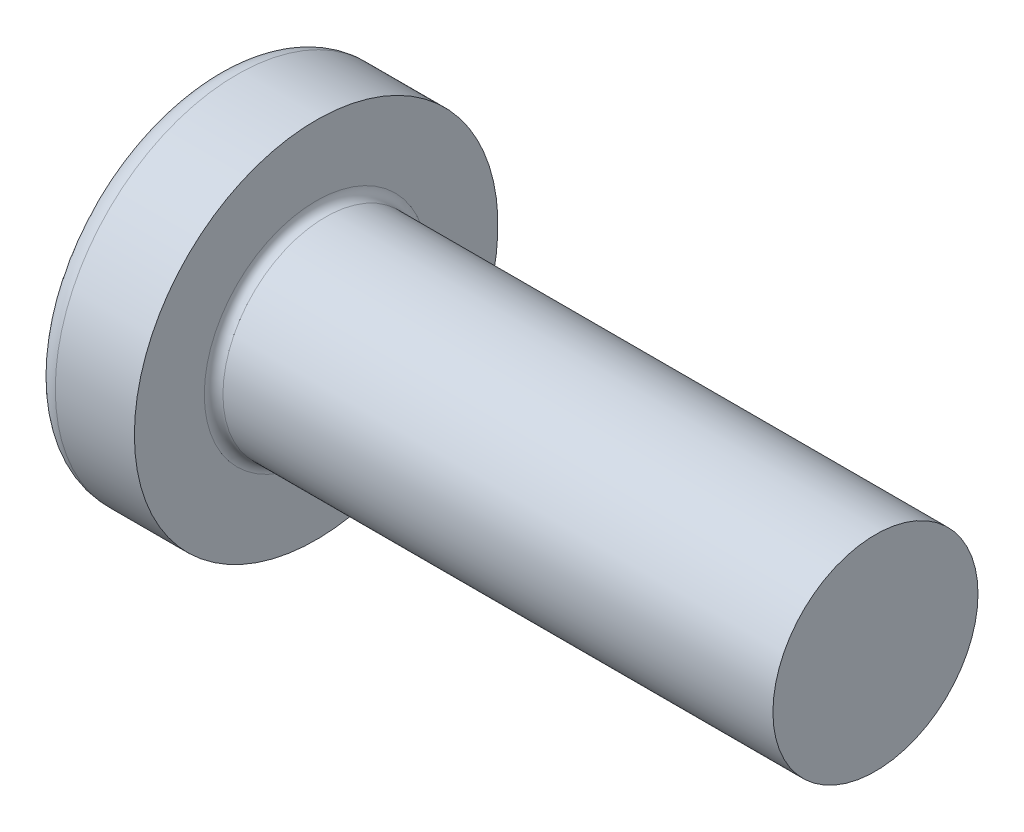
ISO-10303-21;
HEADER;
FILE_DESCRIPTION(('STEP AP214'),'2;1');
FILE_NAME('part.step','',(''),(''),'','','');
FILE_SCHEMA(('AUTOMOTIVE_DESIGN { 1 0 10303 214 1 1 1 1 }'));
ENDSEC;
DATA;
#1=APPLICATION_CONTEXT('core data for automotive mechanical design processes');
#2=APPLICATION_PROTOCOL_DEFINITION('international standard','automotive_design',2000,#1);
#3=PRODUCT_CONTEXT('',#1,'mechanical');
#4=PRODUCT('Part','Part','',(#3));
#5=PRODUCT_RELATED_PRODUCT_CATEGORY('part','',(#4));
#6=PRODUCT_DEFINITION_FORMATION('','',#4);
#7=PRODUCT_DEFINITION_CONTEXT('part definition',#1,'design');
#8=PRODUCT_DEFINITION('design','',#6,#7);
#9=PRODUCT_DEFINITION_SHAPE('','',#8);
#10=(LENGTH_UNIT() NAMED_UNIT(*) SI_UNIT(.MILLI.,.METRE.));
#11=(NAMED_UNIT(*) PLANE_ANGLE_UNIT() SI_UNIT($,.RADIAN.));
#12=(NAMED_UNIT(*) SI_UNIT($,.STERADIAN.) SOLID_ANGLE_UNIT());
#13=UNCERTAINTY_MEASURE_WITH_UNIT(LENGTH_MEASURE(1.E-05),#10,'distance_accuracy_value','');
#14=(GEOMETRIC_REPRESENTATION_CONTEXT(3) GLOBAL_UNCERTAINTY_ASSIGNED_CONTEXT((#13)) GLOBAL_UNIT_ASSIGNED_CONTEXT((#10,
#11,#12)) REPRESENTATION_CONTEXT('',''));
#15=CARTESIAN_POINT('',(0.,0.,0.));
#16=DIRECTION('',(0.,0.,1.));
#17=DIRECTION('',(1.,0.,0.));
#18=AXIS2_PLACEMENT_3D('',#15,#16,#17);
#19=CARTESIAN_POINT('',(1.20000000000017,0.601702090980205,-0.299999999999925));
#20=DIRECTION('',(-1.,0.,0.));
#21=DIRECTION('',(0.,0.,1.));
#22=AXIS2_PLACEMENT_3D('',#19,#20,#21);
#23=PLANE('',#22);
#24=DIRECTION('',(0.,0.,-1.));
#25=VECTOR('',#24,1.);
#26=CARTESIAN_POINT('',(1.20000000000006,0.299999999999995,0.601702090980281));
#27=LINE('',#26,#25);
#28=CARTESIAN_POINT('',(1.20000000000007,0.299999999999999,-0.601702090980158));
#29=VERTEX_POINT('',#28);
#30=CARTESIAN_POINT('',(1.19999999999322,0.300000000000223,-0.468119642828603));
#31=VERTEX_POINT('',#30);
#32=EDGE_CURVE('E270',#29,#31,#27,.F.);
#33=ORIENTED_EDGE('',*,*,#32,.F.);
#34=DIRECTION('',(0.,1.,0.));
#35=VECTOR('',#34,1.);
#36=CARTESIAN_POINT('',(1.20000000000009,0.30000000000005,-0.601702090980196));
#37=LINE('',#36,#35);
#38=CARTESIAN_POINT('',(1.20000000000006,-0.300000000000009,-0.601702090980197));
#39=VERTEX_POINT('',#38);
#40=EDGE_CURVE('E275',#29,#39,#37,.F.);
#41=ORIENTED_EDGE('',*,*,#40,.T.);
#42=DIRECTION('',(0.,0.,1.));
#43=VECTOR('',#42,1.);
#44=CARTESIAN_POINT('',(1.20000000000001,-0.300000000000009,-0.601702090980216));
#45=LINE('',#44,#43);
#46=CARTESIAN_POINT('',(1.19999999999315,-0.300000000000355,-0.468119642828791));
#47=VERTEX_POINT('',#46);
#48=EDGE_CURVE('E322',#47,#39,#45,.F.);
#49=ORIENTED_EDGE('',*,*,#48,.F.);
#50=CARTESIAN_POINT('',(1.20000000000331,0.,0.));
#51=DIRECTION('',(-1.,0.,0.));
#52=DIRECTION('',(0.,0.,1.));
#53=AXIS2_PLACEMENT_3D('',#50,#51,#52);
#54=CIRCLE('',#53,0.556000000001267);
#55=EDGE_CURVE('E545',#47,#31,#54,.F.);
#56=ORIENTED_EDGE('',*,*,#55,.T.);
#57=EDGE_LOOP('',(#33,#41,#49,#56));
#58=FACE_BOUND('',#57,.T.);
#59=ADVANCED_FACE('F17',(#58),#23,.T.);
#60=CARTESIAN_POINT('',(1.20000000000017,0.601702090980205,-0.299999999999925));
#61=DIRECTION('',(-1.,0.,0.));
#62=DIRECTION('',(0.,0.,1.));
#63=AXIS2_PLACEMENT_3D('',#60,#61,#62);
#64=PLANE('',#63);
#65=DIRECTION('',(0.,1.,0.));
#66=VECTOR('',#65,1.);
#67=CARTESIAN_POINT('',(1.20000000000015,-0.601702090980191,0.300000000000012));
#68=LINE('',#67,#66);
#69=CARTESIAN_POINT('',(1.20000000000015,0.601702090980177,0.300000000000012));
#70=VERTEX_POINT('',#69);
#71=CARTESIAN_POINT('',(1.19999999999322,0.468119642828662,0.30000000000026));
#72=VERTEX_POINT('',#71);
#73=EDGE_CURVE('E140',#70,#72,#68,.F.);
#74=ORIENTED_EDGE('',*,*,#73,.F.);
#75=DIRECTION('',(0.,0.,1.));
#76=VECTOR('',#75,1.);
#77=CARTESIAN_POINT('',(1.20000000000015,0.601702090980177,0.300000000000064));
#78=LINE('',#77,#76);
#79=CARTESIAN_POINT('',(1.20000000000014,0.601702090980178,-0.299999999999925));
#80=VERTEX_POINT('',#79);
#81=EDGE_CURVE('E263',#70,#80,#78,.F.);
#82=ORIENTED_EDGE('',*,*,#81,.T.);
#83=DIRECTION('',(0.,1.,0.));
#84=VECTOR('',#83,1.);
#85=CARTESIAN_POINT('',(1.20000000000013,0.601702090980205,-0.299999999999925));
#86=LINE('',#85,#84);
#87=CARTESIAN_POINT('',(1.19999999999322,0.46811964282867,-0.300000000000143));
#88=VERTEX_POINT('',#87);
#89=EDGE_CURVE('E143',#88,#80,#86,.T.);
#90=ORIENTED_EDGE('',*,*,#89,.F.);
#91=CARTESIAN_POINT('',(1.20000000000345,0.,0.));
#92=DIRECTION('',(-1.,0.,0.));
#93=DIRECTION('',(0.,0.,1.));
#94=AXIS2_PLACEMENT_3D('',#91,#92,#93);
#95=CIRCLE('',#94,0.556000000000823);
#96=EDGE_CURVE('E137',#88,#72,#95,.F.);
#97=ORIENTED_EDGE('',*,*,#96,.T.);
#98=EDGE_LOOP('',(#74,#82,#90,#97));
#99=FACE_BOUND('',#98,.T.);
#100=ADVANCED_FACE('F139',(#99),#64,.T.);
#101=CARTESIAN_POINT('',(1.20000000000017,0.601702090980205,-0.299999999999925));
#102=DIRECTION('',(-1.,0.,0.));
#103=DIRECTION('',(0.,0.,1.));
#104=AXIS2_PLACEMENT_3D('',#101,#102,#103);
#105=PLANE('',#104);
#106=DIRECTION('',(0.,0.,1.));
#107=VECTOR('',#106,1.);
#108=CARTESIAN_POINT('',(1.20000000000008,-0.300000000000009,-0.601702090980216));
#109=LINE('',#108,#107);
#110=CARTESIAN_POINT('',(1.20000000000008,-0.300000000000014,0.601702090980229));
#111=VERTEX_POINT('',#110);
#112=CARTESIAN_POINT('',(1.19999999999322,-0.300000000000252,0.468119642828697));
#113=VERTEX_POINT('',#112);
#114=EDGE_CURVE('E251',#111,#113,#109,.F.);
#115=ORIENTED_EDGE('',*,*,#114,.F.);
#116=DIRECTION('',(0.,1.,0.));
#117=VECTOR('',#116,1.);
#118=CARTESIAN_POINT('',(1.20000000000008,-0.30000000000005,0.601702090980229));
#119=LINE('',#118,#117);
#120=CARTESIAN_POINT('',(1.20000000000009,0.299999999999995,0.601702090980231));
#121=VERTEX_POINT('',#120);
#122=EDGE_CURVE('E256',#111,#121,#119,.T.);
#123=ORIENTED_EDGE('',*,*,#122,.T.);
#124=DIRECTION('',(0.,0.,-1.));
#125=VECTOR('',#124,1.);
#126=CARTESIAN_POINT('',(1.20000000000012,0.299999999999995,0.601702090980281));
#127=LINE('',#126,#125);
#128=CARTESIAN_POINT('',(1.19999999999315,0.300000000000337,0.468119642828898));
#129=VERTEX_POINT('',#128);
#130=EDGE_CURVE('E300',#129,#121,#127,.F.);
#131=ORIENTED_EDGE('',*,*,#130,.F.);
#132=CARTESIAN_POINT('',(1.20000000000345,0.,0.));
#133=DIRECTION('',(-1.,0.,0.));
#134=DIRECTION('',(0.,0.,1.));
#135=AXIS2_PLACEMENT_3D('',#132,#133,#134);
#136=CIRCLE('',#135,0.556000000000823);
#137=EDGE_CURVE('E149',#129,#113,#136,.F.);
#138=ORIENTED_EDGE('',*,*,#137,.T.);
#139=EDGE_LOOP('',(#115,#123,#131,#138));
#140=FACE_BOUND('',#139,.T.);
#141=ADVANCED_FACE('F560',(#140),#105,.T.);
#142=CARTESIAN_POINT('',(1.20000000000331,0.,0.));
#143=DIRECTION('',(-1.,0.,0.));
#144=DIRECTION('',(0.,0.,1.));
#145=AXIS2_PLACEMENT_3D('',#142,#143,#144);
#146=CONICAL_SURFACE('',#145,0.556000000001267,1.25663706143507);
#147=CARTESIAN_POINT('',(1.38065535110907,0.,-1.11022302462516E-12));
#148=VERTEX_POINT('',#147);
#149=VERTEX_LOOP('',#148);
#150=FACE_BOUND('',#149,.T.);
#151=CARTESIAN_POINT('',(1.19999999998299,0.,0.));
#152=DIRECTION('',(-1.,0.,0.));
#153=DIRECTION('',(0.,0.,1.));
#154=AXIS2_PLACEMENT_3D('',#151,#152,#153);
#155=CIRCLE('',#154,0.556000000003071);
#156=EDGE_CURVE('E269',#88,#31,#155,.T.);
#157=ORIENTED_EDGE('',*,*,#156,.T.);
#158=ORIENTED_EDGE('',*,*,#55,.F.);
#159=CARTESIAN_POINT('',(1.19999999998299,0.,0.));
#160=DIRECTION('',(-1.,0.,0.));
#161=DIRECTION('',(0.,0.,1.));
#162=AXIS2_PLACEMENT_3D('',#159,#160,#161);
#163=CIRCLE('',#162,0.556000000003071);
#164=CARTESIAN_POINT('',(1.19999999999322,-0.468119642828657,-0.300000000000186));
#165=VERTEX_POINT('',#164);
#166=EDGE_CURVE('E330',#47,#165,#163,.T.);
#167=ORIENTED_EDGE('',*,*,#166,.T.);
#168=CARTESIAN_POINT('',(1.20000000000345,0.,0.));
#169=DIRECTION('',(-1.,0.,0.));
#170=DIRECTION('',(0.,0.,1.));
#171=AXIS2_PLACEMENT_3D('',#168,#169,#170);
#172=CIRCLE('',#171,0.556000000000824);
#173=CARTESIAN_POINT('',(1.19999999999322,-0.468119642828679,0.300000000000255));
#174=VERTEX_POINT('',#173);
#175=EDGE_CURVE('E290',#174,#165,#172,.F.);
#176=ORIENTED_EDGE('',*,*,#175,.F.);
#177=CARTESIAN_POINT('',(1.19999999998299,0.,0.));
#178=DIRECTION('',(-1.,0.,0.));
#179=DIRECTION('',(0.,0.,1.));
#180=AXIS2_PLACEMENT_3D('',#177,#178,#179);
#181=CIRCLE('',#180,0.556000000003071);
#182=EDGE_CURVE('E250',#174,#113,#181,.T.);
#183=ORIENTED_EDGE('',*,*,#182,.T.);
#184=ORIENTED_EDGE('',*,*,#137,.F.);
#185=CARTESIAN_POINT('',(1.19999999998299,0.,0.));
#186=DIRECTION('',(-1.,0.,0.));
#187=DIRECTION('',(0.,0.,1.));
#188=AXIS2_PLACEMENT_3D('',#185,#186,#187);
#189=CIRCLE('',#188,0.556000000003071);
#190=EDGE_CURVE('E162',#129,#72,#189,.T.);
#191=ORIENTED_EDGE('',*,*,#190,.T.);
#192=ORIENTED_EDGE('',*,*,#96,.F.);
#193=EDGE_LOOP('',(#157,#158,#167,#176,#183,#184,#191,#192));
#194=FACE_BOUND('',#193,.T.);
#195=ADVANCED_FACE('F163',(#150,#194),#146,.F.);
#196=CARTESIAN_POINT('',(1.20000000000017,0.601702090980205,-0.299999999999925));
#197=DIRECTION('',(-1.,0.,0.));
#198=DIRECTION('',(0.,0.,1.));
#199=AXIS2_PLACEMENT_3D('',#196,#197,#198);
#200=PLANE('',#199);
#201=DIRECTION('',(0.,1.,0.));
#202=VECTOR('',#201,1.);
#203=CARTESIAN_POINT('',(1.20000000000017,0.601702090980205,-0.299999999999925));
#204=LINE('',#203,#202);
#205=CARTESIAN_POINT('',(1.20000000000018,-0.601702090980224,-0.299999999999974));
#206=VERTEX_POINT('',#205);
#207=EDGE_CURVE('E286',#206,#165,#204,.T.);
#208=ORIENTED_EDGE('',*,*,#207,.F.);
#209=DIRECTION('',(0.,0.,1.));
#210=VECTOR('',#209,1.);
#211=CARTESIAN_POINT('',(1.20000000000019,-0.601702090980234,-0.300000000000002));
#212=LINE('',#211,#210);
#213=CARTESIAN_POINT('',(1.20000000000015,-0.601702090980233,0.300000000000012));
#214=VERTEX_POINT('',#213);
#215=EDGE_CURVE('E238',#206,#214,#212,.T.);
#216=ORIENTED_EDGE('',*,*,#215,.T.);
#217=DIRECTION('',(0.,1.,0.));
#218=VECTOR('',#217,1.);
#219=CARTESIAN_POINT('',(1.20000000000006,-0.601702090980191,0.300000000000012));
#220=LINE('',#219,#218);
#221=EDGE_CURVE('E244',#174,#214,#220,.F.);
#222=ORIENTED_EDGE('',*,*,#221,.F.);
#223=ORIENTED_EDGE('',*,*,#175,.T.);
#224=EDGE_LOOP('',(#208,#216,#222,#223));
#225=FACE_BOUND('',#224,.T.);
#226=ADVANCED_FACE('F549',(#225),#200,.T.);
#227=CARTESIAN_POINT('',(1.20000000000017,0.601702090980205,-0.299999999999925));
#228=DIRECTION('',(0.,0.,1.));
#229=DIRECTION('',(1.,0.,0.));
#230=AXIS2_PLACEMENT_3D('',#227,#228,#229);
#231=PLANE('',#230);
#232=CARTESIAN_POINT('',(0.170303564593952,-1.11508977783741,-0.299999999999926));
#233=CARTESIAN_POINT('',(0.143844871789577,-1.02418894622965,-0.299999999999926));
#234=CARTESIAN_POINT('',(0.12066873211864,-0.932580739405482,-0.299999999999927));
#235=CARTESIAN_POINT('',(0.080881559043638,-0.747949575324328,-0.299999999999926));
#236=CARTESIAN_POINT('',(0.0642705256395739,-0.654926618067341,-0.299999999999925));
#237=CARTESIAN_POINT('',(0.0509420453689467,-0.561196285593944,-0.299999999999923));
#238=B_SPLINE_CURVE_WITH_KNOTS('',3,(#232,#233,#234,#235,#236,#237),.UNSPECIFIED.,.F.,.F.,(4,2,
4),(0.,0.283483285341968,0.566966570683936),.UNSPECIFIED.);
#239=CARTESIAN_POINT('',(0.170303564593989,-1.11508977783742,-0.299999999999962));
#240=VERTEX_POINT('',#239);
#241=CARTESIAN_POINT('',(0.0509420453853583,-0.561196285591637,-0.299999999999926));
#242=VERTEX_POINT('',#241);
#243=EDGE_CURVE('E237',#240,#242,#238,.T.);
#244=ORIENTED_EDGE('',*,*,#243,.F.);
#245=DIRECTION('',(0.89493436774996,0.446197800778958,0.));
#246=VECTOR('',#245,1.);
#247=CARTESIAN_POINT('',(1.66533453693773E-13,-1.20000000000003,-0.299999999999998));
#248=LINE('',#247,#246);
#249=EDGE_CURVE('E241',#240,#206,#248,.T.);
#250=ORIENTED_EDGE('',*,*,#249,.T.);
#251=ORIENTED_EDGE('',*,*,#207,.T.);
#252=CARTESIAN_POINT('',(1.19999999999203,-0.468119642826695,-0.299999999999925));
#253=CARTESIAN_POINT('',(1.00851907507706,-0.4839872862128,-0.299999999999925));
#254=CARTESIAN_POINT('',(0.817023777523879,-0.49967749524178,-0.299999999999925));
#255=CARTESIAN_POINT('',(0.43400445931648,-0.530703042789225,-0.299999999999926));
#256=CARTESIAN_POINT('',(0.242480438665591,-0.546038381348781,-0.299999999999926));
#257=CARTESIAN_POINT('',(0.0509420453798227,-0.561196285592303,-0.299999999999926));
#258=B_SPLINE_CURVE_WITH_KNOTS('',3,(#252,#253,#254,#255,#256,#257),.UNSPECIFIED.,.F.,.F.,(4,2,
4),(0.,0.576411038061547,1.15282200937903),.UNSPECIFIED.);
#259=EDGE_CURVE('E289',#165,#242,#258,.T.);
#260=ORIENTED_EDGE('',*,*,#259,.T.);
#261=EDGE_LOOP('',(#244,#250,#251,#260));
#262=FACE_BOUND('',#261,.T.);
#263=ADVANCED_FACE('F470',(#262),#231,.T.);
#264=CARTESIAN_POINT('',(0.0509420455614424,0.,0.));
#265=DIRECTION('',(-1.,0.,0.));
#266=DIRECTION('',(0.,0.,1.));
#267=AXIS2_PLACEMENT_3D('',#264,#265,#266);
#268=CONICAL_SURFACE('',#267,0.63634995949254,0.0698131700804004);
#269=CARTESIAN_POINT('',(0.0509420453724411,-0.300000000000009,-0.5611962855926));
#270=CARTESIAN_POINT('',(0.242480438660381,-0.300000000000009,-0.546038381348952));
#271=CARTESIAN_POINT('',(0.434004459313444,-0.300000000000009,-0.530703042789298));
#272=CARTESIAN_POINT('',(0.817023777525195,-0.300000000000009,-0.499677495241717));
#273=CARTESIAN_POINT('',(1.00851907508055,-0.300000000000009,-0.483987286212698));
#274=CARTESIAN_POINT('',(1.19999999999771,-0.300000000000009,-0.468119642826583));
#275=B_SPLINE_CURVE_WITH_KNOTS('',3,(#269,#270,#271,#272,#273,#274),.UNSPECIFIED.,.F.,.F.,(4,2,
4),(0.,0.576410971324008,1.15282200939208),.UNSPECIFIED.);
#276=CARTESIAN_POINT('',(0.0509420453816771,-0.300000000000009,-0.561196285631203));
#277=VERTEX_POINT('',#276);
#278=EDGE_CURVE('E327',#277,#47,#275,.T.);
#279=ORIENTED_EDGE('',*,*,#278,.F.);
#280=CARTESIAN_POINT('',(0.0509420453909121,0.,0.));
#281=DIRECTION('',(-1.,0.,0.));
#282=DIRECTION('',(0.,0.,1.));
#283=AXIS2_PLACEMENT_3D('',#280,#281,#282);
#284=CIRCLE('',#283,0.636349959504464);
#285=EDGE_CURVE('E462',#242,#277,#284,.F.);
#286=ORIENTED_EDGE('',*,*,#285,.F.);
#287=ORIENTED_EDGE('',*,*,#259,.F.);
#288=ORIENTED_EDGE('',*,*,#166,.F.);
#289=EDGE_LOOP('',(#279,#286,#287,#288));
#290=FACE_BOUND('',#289,.T.);
#291=ADVANCED_FACE('F443',(#290),#268,.F.);
#292=CARTESIAN_POINT('',(1.20000000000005,-0.300000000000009,-0.601702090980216));
#293=DIRECTION('',(0.,1.,0.));
#294=DIRECTION('',(0.,0.,1.));
#295=AXIS2_PLACEMENT_3D('',#292,#293,#294);
#296=PLANE('',#295);
#297=ORIENTED_EDGE('',*,*,#48,.T.);
#298=DIRECTION('',(-0.894934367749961,0.,-0.446197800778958));
#299=VECTOR('',#298,1.);
#300=CARTESIAN_POINT('',(1.11854539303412E-13,-0.300000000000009,-1.19999999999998));
#301=LINE('',#300,#299);
#302=CARTESIAN_POINT('',(0.170303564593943,-0.30000000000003,-1.11508977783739));
#303=VERTEX_POINT('',#302);
#304=EDGE_CURVE('E273',#39,#303,#301,.T.);
#305=ORIENTED_EDGE('',*,*,#304,.T.);
#306=CARTESIAN_POINT('',(4.0000000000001,-0.300000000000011,0.));
#307=DIRECTION('',(0.,1.,0.));
#308=DIRECTION('',(-1.,0.,0.));
#309=AXIS2_PLACEMENT_3D('',#306,#307,#308);
#310=CIRCLE('',#309,3.98873413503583);
#311=EDGE_CURVE('E460',#277,#303,#310,.F.);
#312=ORIENTED_EDGE('',*,*,#311,.F.);
#313=ORIENTED_EDGE('',*,*,#278,.T.);
#314=EDGE_LOOP('',(#297,#305,#312,#313));
#315=FACE_BOUND('',#314,.T.);
#316=ADVANCED_FACE('F445',(#315),#296,.T.);
#317=CARTESIAN_POINT('',(1.11022302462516E-13,0.30000000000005,-1.19999999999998));
#318=DIRECTION('',(0.446197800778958,0.,-0.894934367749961));
#319=DIRECTION('',(-0.894934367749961,0.,-0.446197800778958));
#320=AXIS2_PLACEMENT_3D('',#317,#318,#319);
#321=PLANE('',#320);
#322=ORIENTED_EDGE('',*,*,#40,.F.);
#323=DIRECTION('',(0.894934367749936,0.,0.446197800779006));
#324=VECTOR('',#323,1.);
#325=CARTESIAN_POINT('',(0.170303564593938,0.300000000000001,-1.11508977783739));
#326=LINE('',#325,#324);
#327=CARTESIAN_POINT('',(0.170303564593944,0.300000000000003,-1.11508977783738));
#328=VERTEX_POINT('',#327);
#329=EDGE_CURVE('E266',#328,#29,#326,.T.);
#330=ORIENTED_EDGE('',*,*,#329,.F.);
#331=CARTESIAN_POINT('',(0.170303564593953,-0.300000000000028,-1.11508977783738));
#332=CARTESIAN_POINT('',(0.163473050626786,-0.200000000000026,-1.11849534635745));
#333=CARTESIAN_POINT('',(0.160057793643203,-0.100000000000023,-1.12019813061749));
#334=CARTESIAN_POINT('',(0.160057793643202,0.0999999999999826,-1.12019813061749));
#335=CARTESIAN_POINT('',(0.163473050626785,0.199999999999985,-1.11849534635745));
#336=CARTESIAN_POINT('',(0.170303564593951,0.299999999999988,-1.11508977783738));
#337=B_SPLINE_CURVE_WITH_KNOTS('',3,(#331,#332,#333,#334,#335,#336),.UNSPECIFIED.,.F.,.F.,(4,2,
4),(0.,0.300218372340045,0.600436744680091),.UNSPECIFIED.);
#338=EDGE_CURVE('E454',#303,#328,#337,.T.);
#339=ORIENTED_EDGE('',*,*,#338,.F.);
#340=ORIENTED_EDGE('',*,*,#304,.F.);
#341=EDGE_LOOP('',(#322,#330,#339,#340));
#342=FACE_BOUND('',#341,.T.);
#343=ADVANCED_FACE('F448',(#342),#321,.F.);
#344=CARTESIAN_POINT('',(1.20000000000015,0.299999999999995,0.601702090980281));
#345=DIRECTION('',(0.,-1.,0.));
#346=DIRECTION('',(0.,0.,-1.));
#347=AXIS2_PLACEMENT_3D('',#344,#345,#346);
#348=PLANE('',#347);
#349=CARTESIAN_POINT('',(4.0000000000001,0.3,0.));
#350=DIRECTION('',(0.,1.,0.));
#351=DIRECTION('',(-1.,0.,0.));
#352=AXIS2_PLACEMENT_3D('',#349,#350,#351);
#353=CIRCLE('',#352,3.98873413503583);
#354=CARTESIAN_POINT('',(0.050942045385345,0.3,-0.561196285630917));
#355=VERTEX_POINT('',#354);
#356=EDGE_CURVE('E408',#328,#355,#353,.T.);
#357=ORIENTED_EDGE('',*,*,#356,.F.);
#358=ORIENTED_EDGE('',*,*,#329,.T.);
#359=ORIENTED_EDGE('',*,*,#32,.T.);
#360=CARTESIAN_POINT('',(1.19999999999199,0.299999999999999,-0.468119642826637));
#361=CARTESIAN_POINT('',(1.00851907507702,0.299999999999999,-0.483987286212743));
#362=CARTESIAN_POINT('',(0.817023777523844,0.299999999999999,-0.499677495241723));
#363=CARTESIAN_POINT('',(0.43400445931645,0.299999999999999,-0.530703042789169));
#364=CARTESIAN_POINT('',(0.242480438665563,0.299999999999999,-0.546038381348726));
#365=CARTESIAN_POINT('',(0.050942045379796,0.299999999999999,-0.561196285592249));
#366=B_SPLINE_CURVE_WITH_KNOTS('',3,(#360,#361,#362,#363,#364,#365),.UNSPECIFIED.,.F.,.F.,(4,2,
4),(0.,0.576411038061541,1.15282200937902),.UNSPECIFIED.);
#367=EDGE_CURVE('E316',#31,#355,#366,.T.);
#368=ORIENTED_EDGE('',*,*,#367,.T.);
#369=EDGE_LOOP('',(#357,#358,#359,#368));
#370=FACE_BOUND('',#369,.T.);
#371=ADVANCED_FACE('F423',(#370),#348,.T.);
#372=CARTESIAN_POINT('',(0.0509420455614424,0.,0.));
#373=DIRECTION('',(-1.,0.,0.));
#374=DIRECTION('',(0.,0.,1.));
#375=AXIS2_PLACEMENT_3D('',#372,#373,#374);
#376=CONICAL_SURFACE('',#375,0.63634995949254,0.0698131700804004);
#377=ORIENTED_EDGE('',*,*,#367,.F.);
#378=ORIENTED_EDGE('',*,*,#156,.F.);
#379=CARTESIAN_POINT('',(0.0509420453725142,0.561196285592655,-0.299999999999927));
#380=CARTESIAN_POINT('',(0.242480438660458,0.546038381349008,-0.299999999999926));
#381=CARTESIAN_POINT('',(0.434004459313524,0.530703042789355,-0.299999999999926));
#382=CARTESIAN_POINT('',(0.817023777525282,0.499677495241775,-0.299999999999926));
#383=CARTESIAN_POINT('',(1.00851907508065,0.483987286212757,-0.299999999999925));
#384=CARTESIAN_POINT('',(1.1999999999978,0.468119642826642,-0.299999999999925));
#385=B_SPLINE_CURVE_WITH_KNOTS('',3,(#379,#380,#381,#382,#383,#384),.UNSPECIFIED.,.F.,.F.,(4,2,
4),(0.,0.576410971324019,1.1528220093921),.UNSPECIFIED.);
#386=CARTESIAN_POINT('',(0.0509420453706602,0.561196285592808,-0.299999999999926));
#387=VERTEX_POINT('',#386);
#388=EDGE_CURVE('E187',#387,#88,#385,.T.);
#389=ORIENTED_EDGE('',*,*,#388,.F.);
#390=CARTESIAN_POINT('',(0.0509420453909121,0.,0.));
#391=DIRECTION('',(-1.,0.,0.));
#392=DIRECTION('',(0.,0.,1.));
#393=AXIS2_PLACEMENT_3D('',#390,#391,#392);
#394=CIRCLE('',#393,0.636349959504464);
#395=EDGE_CURVE('E407',#355,#387,#394,.F.);
#396=ORIENTED_EDGE('',*,*,#395,.F.);
#397=EDGE_LOOP('',(#377,#378,#389,#396));
#398=FACE_BOUND('',#397,.T.);
#399=ADVANCED_FACE('F417',(#398),#376,.F.);
#400=CARTESIAN_POINT('',(1.20000000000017,0.601702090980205,-0.299999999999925));
#401=DIRECTION('',(0.,0.,1.));
#402=DIRECTION('',(1.,0.,0.));
#403=AXIS2_PLACEMENT_3D('',#400,#401,#402);
#404=PLANE('',#403);
#405=ORIENTED_EDGE('',*,*,#89,.T.);
#406=DIRECTION('',(-0.89493436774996,0.446197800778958,0.));
#407=VECTOR('',#406,1.);
#408=CARTESIAN_POINT('',(1.20000000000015,0.601702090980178,-0.299999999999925));
#409=LINE('',#408,#407);
#410=CARTESIAN_POINT('',(0.170303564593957,1.11508977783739,-0.299999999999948));
#411=VERTEX_POINT('',#410);
#412=EDGE_CURVE('E159',#80,#411,#409,.T.);
#413=ORIENTED_EDGE('',*,*,#412,.T.);
#414=CARTESIAN_POINT('',(0.0509420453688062,0.561196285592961,-0.299999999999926));
#415=CARTESIAN_POINT('',(0.0642705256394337,0.654926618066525,-0.299999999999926));
#416=CARTESIAN_POINT('',(0.0808815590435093,0.747949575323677,-0.299999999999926));
#417=CARTESIAN_POINT('',(0.120668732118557,0.932580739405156,-0.299999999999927));
#418=CARTESIAN_POINT('',(0.143844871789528,1.02418894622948,-0.299999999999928));
#419=CARTESIAN_POINT('',(0.170303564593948,1.1150897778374,-0.299999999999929));
#420=B_SPLINE_CURVE_WITH_KNOTS('',3,(#414,#415,#416,#417,#418,#419),.UNSPECIFIED.,.F.,.F.,(4,2,
4),(0.,0.28348328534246,0.56696657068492),.UNSPECIFIED.);
#421=EDGE_CURVE('E404',#387,#411,#420,.T.);
#422=ORIENTED_EDGE('',*,*,#421,.F.);
#423=ORIENTED_EDGE('',*,*,#388,.T.);
#424=EDGE_LOOP('',(#405,#413,#422,#423));
#425=FACE_BOUND('',#424,.T.);
#426=ADVANCED_FACE('F414',(#425),#404,.T.);
#427=CARTESIAN_POINT('',(1.20000000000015,0.601702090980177,0.300000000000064));
#428=DIRECTION('',(0.446197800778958,0.89493436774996,0.));
#429=DIRECTION('',(-0.89493436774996,0.446197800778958,0.));
#430=AXIS2_PLACEMENT_3D('',#427,#428,#429);
#431=PLANE('',#430);
#432=ORIENTED_EDGE('',*,*,#81,.F.);
#433=DIRECTION('',(0.894934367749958,-0.446197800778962,0.));
#434=VECTOR('',#433,1.);
#435=CARTESIAN_POINT('',(0.170303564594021,1.11508977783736,0.300000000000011));
#436=LINE('',#435,#434);
#437=CARTESIAN_POINT('',(0.170303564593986,1.11508977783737,0.30000000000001));
#438=VERTEX_POINT('',#437);
#439=EDGE_CURVE('E158',#438,#70,#436,.T.);
#440=ORIENTED_EDGE('',*,*,#439,.F.);
#441=CARTESIAN_POINT('',(0.17030356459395,1.11508977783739,-0.299999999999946));
#442=CARTESIAN_POINT('',(0.163473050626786,1.11849534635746,-0.199999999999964));
#443=CARTESIAN_POINT('',(0.160057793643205,1.1201981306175,-0.0999999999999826));
#444=CARTESIAN_POINT('',(0.160057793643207,1.1201981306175,0.100000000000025));
#445=CARTESIAN_POINT('',(0.163473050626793,1.11849534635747,0.200000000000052));
#446=CARTESIAN_POINT('',(0.170303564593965,1.11508977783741,0.300000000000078));
#447=B_SPLINE_CURVE_WITH_KNOTS('',3,(#441,#442,#443,#444,#445,#446),.UNSPECIFIED.,.F.,.F.,(4,2,
4),(0.,0.300218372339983,0.600436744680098),.UNSPECIFIED.);
#448=EDGE_CURVE('E209',#411,#438,#447,.T.);
#449=ORIENTED_EDGE('',*,*,#448,.F.);
#450=ORIENTED_EDGE('',*,*,#412,.F.);
#451=EDGE_LOOP('',(#432,#440,#449,#450));
#452=FACE_BOUND('',#451,.T.);
#453=ADVANCED_FACE('F198',(#452),#431,.F.);
#454=CARTESIAN_POINT('',(1.20000000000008,-0.601702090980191,0.300000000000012));
#455=DIRECTION('',(0.,0.,-1.));
#456=DIRECTION('',(-1.,0.,0.));
#457=AXIS2_PLACEMENT_3D('',#454,#455,#456);
#458=PLANE('',#457);
#459=CARTESIAN_POINT('',(0.170303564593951,1.11508977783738,0.30000000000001));
#460=CARTESIAN_POINT('',(0.143844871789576,1.02418894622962,0.300000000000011));
#461=CARTESIAN_POINT('',(0.120668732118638,0.932580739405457,0.300000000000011));
#462=CARTESIAN_POINT('',(0.0808815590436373,0.7479495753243,0.30000000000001));
#463=CARTESIAN_POINT('',(0.064270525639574,0.654926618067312,0.300000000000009));
#464=CARTESIAN_POINT('',(0.0509420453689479,0.561196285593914,0.300000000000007));
#465=B_SPLINE_CURVE_WITH_KNOTS('',3,(#459,#460,#461,#462,#463,#464),.UNSPECIFIED.,.F.,.F.,(4,2,
4),(0.,0.283483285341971,0.566966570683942),.UNSPECIFIED.);
#466=CARTESIAN_POINT('',(0.050942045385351,0.561196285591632,0.300000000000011));
#467=VERTEX_POINT('',#466);
#468=EDGE_CURVE('E202',#438,#467,#465,.T.);
#469=ORIENTED_EDGE('',*,*,#468,.F.);
#470=ORIENTED_EDGE('',*,*,#439,.T.);
#471=ORIENTED_EDGE('',*,*,#73,.T.);
#472=CARTESIAN_POINT('',(1.19999999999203,0.468119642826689,0.300000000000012));
#473=CARTESIAN_POINT('',(1.00851907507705,0.483987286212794,0.300000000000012));
#474=CARTESIAN_POINT('',(0.81702377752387,0.499677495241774,0.300000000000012));
#475=CARTESIAN_POINT('',(0.434004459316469,0.530703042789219,0.300000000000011));
#476=CARTESIAN_POINT('',(0.242480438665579,0.546038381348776,0.300000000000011));
#477=CARTESIAN_POINT('',(0.050942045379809,0.561196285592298,0.300000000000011));
#478=B_SPLINE_CURVE_WITH_KNOTS('',3,(#472,#473,#474,#475,#476,#477),.UNSPECIFIED.,.F.,.F.,(4,2,
4),(0.,0.57641103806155,1.15282200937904),.UNSPECIFIED.);
#479=EDGE_CURVE('E156',#72,#467,#478,.T.);
#480=ORIENTED_EDGE('',*,*,#479,.T.);
#481=EDGE_LOOP('',(#469,#470,#471,#480));
#482=FACE_BOUND('',#481,.T.);
#483=ADVANCED_FACE('F154',(#482),#458,.T.);
#484=CARTESIAN_POINT('',(0.0509420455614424,0.,0.));
#485=DIRECTION('',(-1.,0.,0.));
#486=DIRECTION('',(0.,0.,1.));
#487=AXIS2_PLACEMENT_3D('',#484,#485,#486);
#488=CONICAL_SURFACE('',#487,0.63634995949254,0.0698131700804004);
#489=CARTESIAN_POINT('',(0.0509420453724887,0.299999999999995,0.561196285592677));
#490=CARTESIAN_POINT('',(0.24248043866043,0.299999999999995,0.54603838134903));
#491=CARTESIAN_POINT('',(0.434004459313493,0.299999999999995,0.530703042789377));
#492=CARTESIAN_POINT('',(0.817023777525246,0.299999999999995,0.499677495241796));
#493=CARTESIAN_POINT('',(1.00851907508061,0.299999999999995,0.483987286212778));
#494=CARTESIAN_POINT('',(1.19999999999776,0.299999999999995,0.468119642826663));
#495=B_SPLINE_CURVE_WITH_KNOTS('',3,(#489,#490,#491,#492,#493,#494),.UNSPECIFIED.,.F.,.F.,(4,2,
4),(0.,0.576410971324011,1.15282200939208),.UNSPECIFIED.);
#496=CARTESIAN_POINT('',(0.0509420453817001,0.299999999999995,0.561196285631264));
#497=VERTEX_POINT('',#496);
#498=EDGE_CURVE('E167',#497,#129,#495,.T.);
#499=ORIENTED_EDGE('',*,*,#498,.F.);
#500=CARTESIAN_POINT('',(0.0509420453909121,0.,0.));
#501=DIRECTION('',(-1.,0.,0.));
#502=DIRECTION('',(0.,0.,1.));
#503=AXIS2_PLACEMENT_3D('',#500,#501,#502);
#504=CIRCLE('',#503,0.636349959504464);
#505=EDGE_CURVE('E171',#467,#497,#504,.F.);
#506=ORIENTED_EDGE('',*,*,#505,.F.);
#507=ORIENTED_EDGE('',*,*,#479,.F.);
#508=ORIENTED_EDGE('',*,*,#190,.F.);
#509=EDGE_LOOP('',(#499,#506,#507,#508));
#510=FACE_BOUND('',#509,.T.);
#511=ADVANCED_FACE('F169',(#510),#488,.F.);
#512=CARTESIAN_POINT('',(1.20000000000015,0.299999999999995,0.601702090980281));
#513=DIRECTION('',(0.,-1.,0.));
#514=DIRECTION('',(0.,0.,-1.));
#515=AXIS2_PLACEMENT_3D('',#512,#513,#514);
#516=PLANE('',#515);
#517=ORIENTED_EDGE('',*,*,#130,.T.);
#518=DIRECTION('',(0.894934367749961,0.,-0.446197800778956));
#519=VECTOR('',#518,1.);
#520=CARTESIAN_POINT('',(1.20000000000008,0.299999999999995,0.601702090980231));
#521=LINE('',#520,#519);
#522=CARTESIAN_POINT('',(0.170303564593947,0.299999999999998,1.11508977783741));
#523=VERTEX_POINT('',#522);
#524=EDGE_CURVE('E254',#121,#523,#521,.F.);
#525=ORIENTED_EDGE('',*,*,#524,.T.);
#526=CARTESIAN_POINT('',(4.0000000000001,0.299999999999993,0.));
#527=DIRECTION('',(0.,1.,0.));
#528=DIRECTION('',(-1.,0.,0.));
#529=AXIS2_PLACEMENT_3D('',#526,#527,#528);
#530=CIRCLE('',#529,3.98873413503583);
#531=EDGE_CURVE('E396',#497,#523,#530,.T.);
#532=ORIENTED_EDGE('',*,*,#531,.F.);
#533=ORIENTED_EDGE('',*,*,#498,.T.);
#534=EDGE_LOOP('',(#517,#525,#532,#533));
#535=FACE_BOUND('',#534,.T.);
#536=ADVANCED_FACE('F387',(#535),#516,.T.);
#537=CARTESIAN_POINT('',(1.20000000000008,-0.30000000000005,0.601702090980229));
#538=DIRECTION('',(0.446197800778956,0.,0.894934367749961));
#539=DIRECTION('',(0.894934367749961,0.,-0.446197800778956));
#540=AXIS2_PLACEMENT_3D('',#537,#538,#539);
#541=PLANE('',#540);
#542=ORIENTED_EDGE('',*,*,#122,.F.);
#543=DIRECTION('',(0.894934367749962,0.,-0.446197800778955));
#544=VECTOR('',#543,1.);
#545=CARTESIAN_POINT('',(0.170303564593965,-0.300000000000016,1.1150897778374));
#546=LINE('',#545,#544);
#547=CARTESIAN_POINT('',(0.17030356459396,-0.300000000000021,1.1150897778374));
#548=VERTEX_POINT('',#547);
#549=EDGE_CURVE('E247',#548,#111,#546,.T.);
#550=ORIENTED_EDGE('',*,*,#549,.F.);
#551=CARTESIAN_POINT('',(0.170303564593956,0.300000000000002,1.11508977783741));
#552=CARTESIAN_POINT('',(0.16347305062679,0.200000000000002,1.11849534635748));
#553=CARTESIAN_POINT('',(0.160057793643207,0.100000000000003,1.12019813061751));
#554=CARTESIAN_POINT('',(0.160057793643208,-0.0999999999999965,1.12019813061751));
#555=CARTESIAN_POINT('',(0.16347305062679,-0.199999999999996,1.11849534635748));
#556=CARTESIAN_POINT('',(0.170303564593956,-0.299999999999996,1.11508977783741));
#557=B_SPLINE_CURVE_WITH_KNOTS('',3,(#551,#552,#553,#554,#555,#556),.UNSPECIFIED.,.F.,.F.,(4,2,
4),(0.,0.300218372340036,0.600436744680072),.UNSPECIFIED.);
#558=EDGE_CURVE('E390',#523,#548,#557,.T.);
#559=ORIENTED_EDGE('',*,*,#558,.F.);
#560=ORIENTED_EDGE('',*,*,#524,.F.);
#561=EDGE_LOOP('',(#542,#550,#559,#560));
#562=FACE_BOUND('',#561,.T.);
#563=ADVANCED_FACE('F383',(#562),#541,.F.);
#564=CARTESIAN_POINT('',(1.20000000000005,-0.300000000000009,-0.601702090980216));
#565=DIRECTION('',(0.,1.,0.));
#566=DIRECTION('',(0.,0.,1.));
#567=AXIS2_PLACEMENT_3D('',#564,#565,#566);
#568=PLANE('',#567);
#569=CARTESIAN_POINT('',(4.0000000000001,-0.300000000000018,0.));
#570=DIRECTION('',(0.,1.,0.));
#571=DIRECTION('',(-1.,0.,0.));
#572=AXIS2_PLACEMENT_3D('',#569,#570,#571);
#573=CIRCLE('',#572,3.98873413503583);
#574=CARTESIAN_POINT('',(0.0509420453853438,-0.300000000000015,0.561196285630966));
#575=VERTEX_POINT('',#574);
#576=EDGE_CURVE('E395',#548,#575,#573,.F.);
#577=ORIENTED_EDGE('',*,*,#576,.F.);
#578=ORIENTED_EDGE('',*,*,#549,.T.);
#579=ORIENTED_EDGE('',*,*,#114,.T.);
#580=CARTESIAN_POINT('',(1.19999999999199,-0.300000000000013,0.468119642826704));
#581=CARTESIAN_POINT('',(1.00851907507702,-0.300000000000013,0.48398728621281));
#582=CARTESIAN_POINT('',(0.817023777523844,-0.300000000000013,0.49967749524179));
#583=CARTESIAN_POINT('',(0.434004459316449,-0.300000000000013,0.530703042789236));
#584=CARTESIAN_POINT('',(0.242480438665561,-0.300000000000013,0.546038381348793));
#585=CARTESIAN_POINT('',(0.0509420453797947,-0.300000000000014,0.561196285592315));
#586=B_SPLINE_CURVE_WITH_KNOTS('',3,(#580,#581,#582,#583,#584,#585),.UNSPECIFIED.,.F.,.F.,(4,2,
4),(0.,0.576411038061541,1.15282200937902),.UNSPECIFIED.);
#587=EDGE_CURVE('E294',#113,#575,#586,.T.);
#588=ORIENTED_EDGE('',*,*,#587,.T.);
#589=EDGE_LOOP('',(#577,#578,#579,#588));
#590=FACE_BOUND('',#589,.T.);
#591=ADVANCED_FACE('F379',(#590),#568,.T.);
#592=CARTESIAN_POINT('',(0.0509420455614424,0.,0.));
#593=DIRECTION('',(-1.,0.,0.));
#594=DIRECTION('',(0.,0.,1.));
#595=AXIS2_PLACEMENT_3D('',#592,#593,#594);
#596=CONICAL_SURFACE('',#595,0.63634995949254,0.0698131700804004);
#597=ORIENTED_EDGE('',*,*,#587,.F.);
#598=ORIENTED_EDGE('',*,*,#182,.F.);
#599=CARTESIAN_POINT('',(0.0509420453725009,-0.561196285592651,0.300000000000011));
#600=CARTESIAN_POINT('',(0.242480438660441,-0.546038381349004,0.300000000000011));
#601=CARTESIAN_POINT('',(0.434004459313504,-0.530703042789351,0.300000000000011));
#602=CARTESIAN_POINT('',(0.817023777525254,-0.499677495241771,0.300000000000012));
#603=CARTESIAN_POINT('',(1.00851907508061,-0.483987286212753,0.300000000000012));
#604=CARTESIAN_POINT('',(1.19999999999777,-0.468119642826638,0.300000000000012));
#605=B_SPLINE_CURVE_WITH_KNOTS('',3,(#599,#600,#601,#602,#603,#604),.UNSPECIFIED.,.F.,.F.,(4,2,
4),(0.,0.576410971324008,1.15282200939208),.UNSPECIFIED.);
#606=CARTESIAN_POINT('',(0.050942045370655,-0.561196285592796,0.300000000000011));
#607=VERTEX_POINT('',#606);
#608=EDGE_CURVE('E280',#607,#174,#605,.T.);
#609=ORIENTED_EDGE('',*,*,#608,.F.);
#610=CARTESIAN_POINT('',(0.0509420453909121,0.,0.));
#611=DIRECTION('',(-1.,0.,0.));
#612=DIRECTION('',(0.,0.,1.));
#613=AXIS2_PLACEMENT_3D('',#610,#611,#612);
#614=CIRCLE('',#613,0.636349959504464);
#615=EDGE_CURVE('E354',#575,#607,#614,.F.);
#616=ORIENTED_EDGE('',*,*,#615,.F.);
#617=EDGE_LOOP('',(#597,#598,#609,#616));
#618=FACE_BOUND('',#617,.T.);
#619=ADVANCED_FACE('F360',(#618),#596,.F.);
#620=CARTESIAN_POINT('',(1.20000000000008,-0.601702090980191,0.300000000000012));
#621=DIRECTION('',(0.,0.,-1.));
#622=DIRECTION('',(-1.,0.,0.));
#623=AXIS2_PLACEMENT_3D('',#620,#621,#622);
#624=PLANE('',#623);
#625=ORIENTED_EDGE('',*,*,#221,.T.);
#626=DIRECTION('',(0.89493436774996,0.446197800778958,0.));
#627=VECTOR('',#626,1.);
#628=CARTESIAN_POINT('',(1.66503730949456E-13,-1.20000000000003,0.300000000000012));
#629=LINE('',#628,#627);
#630=CARTESIAN_POINT('',(0.170303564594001,-1.11508977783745,0.300000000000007));
#631=VERTEX_POINT('',#630);
#632=EDGE_CURVE('E235',#214,#631,#629,.F.);
#633=ORIENTED_EDGE('',*,*,#632,.T.);
#634=CARTESIAN_POINT('',(0.0509420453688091,-0.561196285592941,0.300000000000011));
#635=CARTESIAN_POINT('',(0.064270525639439,-0.654926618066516,0.30000000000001));
#636=CARTESIAN_POINT('',(0.0808815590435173,-0.747949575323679,0.30000000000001));
#637=CARTESIAN_POINT('',(0.120668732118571,-0.932580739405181,0.300000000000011));
#638=CARTESIAN_POINT('',(0.143844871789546,-1.02418894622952,0.300000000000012));
#639=CARTESIAN_POINT('',(0.17030356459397,-1.11508977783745,0.300000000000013));
#640=B_SPLINE_CURVE_WITH_KNOTS('',3,(#634,#635,#636,#637,#638,#639),.UNSPECIFIED.,.F.,.F.,(4,2,
4),(0.,0.283483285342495,0.56696657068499),.UNSPECIFIED.);
#641=EDGE_CURVE('E348',#607,#631,#640,.T.);
#642=ORIENTED_EDGE('',*,*,#641,.F.);
#643=ORIENTED_EDGE('',*,*,#608,.T.);
#644=EDGE_LOOP('',(#625,#633,#642,#643));
#645=FACE_BOUND('',#644,.T.);
#646=ADVANCED_FACE('F356',(#645),#624,.T.);
#647=CARTESIAN_POINT('',(1.66533453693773E-13,-1.20000000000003,-0.300000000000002));
#648=DIRECTION('',(0.446197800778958,-0.89493436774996,0.));
#649=DIRECTION('',(0.89493436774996,0.446197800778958,0.));
#650=AXIS2_PLACEMENT_3D('',#647,#648,#649);
#651=PLANE('',#650);
#652=ORIENTED_EDGE('',*,*,#215,.F.);
#653=ORIENTED_EDGE('',*,*,#249,.F.);
#654=CARTESIAN_POINT('',(0.170303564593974,-1.11508977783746,0.30000000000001));
#655=CARTESIAN_POINT('',(0.163473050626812,-1.11849534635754,0.200000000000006));
#656=CARTESIAN_POINT('',(0.160057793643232,-1.12019813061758,0.100000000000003));
#657=CARTESIAN_POINT('',(0.160057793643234,-1.12019813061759,-0.0999999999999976));
#658=CARTESIAN_POINT('',(0.163473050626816,-1.11849534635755,-0.199999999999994));
#659=CARTESIAN_POINT('',(0.17030356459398,-1.11508977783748,-0.299999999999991));
#660=B_SPLINE_CURVE_WITH_KNOTS('',3,(#654,#655,#656,#657,#658,#659),.UNSPECIFIED.,.F.,.F.,(4,2,
4),(0.,0.300218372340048,0.600436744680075),.UNSPECIFIED.);
#661=EDGE_CURVE('E343',#631,#240,#660,.T.);
#662=ORIENTED_EDGE('',*,*,#661,.F.);
#663=ORIENTED_EDGE('',*,*,#632,.F.);
#664=EDGE_LOOP('',(#652,#653,#662,#663));
#665=FACE_BOUND('',#664,.T.);
#666=ADVANCED_FACE('F222',(#665),#651,.F.);
#667=CARTESIAN_POINT('',(4.0000000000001,0.,0.));
#668=DIRECTION('',(0.,1.,0.));
#669=DIRECTION('',(1.,0.,0.));
#670=AXIS2_PLACEMENT_3D('',#667,#668,#669);
#671=SPHERICAL_SURFACE('',#670,4.);
#672=CARTESIAN_POINT('',(0.437599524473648,0.,0.));
#673=DIRECTION('',(-1.,0.,0.));
#674=DIRECTION('',(0.,0.,1.));
#675=AXIS2_PLACEMENT_3D('',#672,#673,#674);
#676=CIRCLE('',#675,1.81914893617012);
#677=CARTESIAN_POINT('',(0.437599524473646,0.,1.81914893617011));
#678=VERTEX_POINT('',#677);
#679=EDGE_CURVE('E339',#678,#678,#676,.F.);
#680=ORIENTED_EDGE('',*,*,#679,.F.);
#681=EDGE_LOOP('',(#680));
#682=FACE_BOUND('',#681,.T.);
#683=ORIENTED_EDGE('',*,*,#641,.T.);
#684=ORIENTED_EDGE('',*,*,#661,.T.);
#685=ORIENTED_EDGE('',*,*,#243,.T.);
#686=ORIENTED_EDGE('',*,*,#285,.T.);
#687=ORIENTED_EDGE('',*,*,#311,.T.);
#688=ORIENTED_EDGE('',*,*,#338,.T.);
#689=ORIENTED_EDGE('',*,*,#356,.T.);
#690=ORIENTED_EDGE('',*,*,#395,.T.);
#691=ORIENTED_EDGE('',*,*,#421,.T.);
#692=ORIENTED_EDGE('',*,*,#448,.T.);
#693=ORIENTED_EDGE('',*,*,#468,.T.);
#694=ORIENTED_EDGE('',*,*,#505,.T.);
#695=ORIENTED_EDGE('',*,*,#531,.T.);
#696=ORIENTED_EDGE('',*,*,#558,.T.);
#697=ORIENTED_EDGE('',*,*,#576,.T.);
#698=ORIENTED_EDGE('',*,*,#615,.T.);
#699=EDGE_LOOP('',(#683,#684,#685,#686,#687,#688,#689,#690,#691,#692,#693,#694,#695,#696,#697,#698));
#700=FACE_BOUND('',#699,.T.);
#701=ADVANCED_FACE('F215',(#682,#700),#671,.T.);
#702=CARTESIAN_POINT('',(0.651343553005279,0.,0.));
#703=DIRECTION('',(-1.,0.,0.));
#704=DIRECTION('',(0.,0.,1.));
#705=AXIS2_PLACEMENT_3D('',#702,#703,#704);
#706=TOROIDAL_SURFACE('',#705,1.71,0.24);
#707=ORIENTED_EDGE('',*,*,#679,.T.);
#708=EDGE_LOOP('',(#707));
#709=FACE_BOUND('',#708,.T.);
#710=CARTESIAN_POINT('',(0.651343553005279,0.,0.));
#711=DIRECTION('',(-1.,0.,0.));
#712=DIRECTION('',(0.,0.,1.));
#713=AXIS2_PLACEMENT_3D('',#710,#711,#712);
#714=CIRCLE('',#713,1.95);
#715=CARTESIAN_POINT('',(0.651343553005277,0.,1.95));
#716=VERTEX_POINT('',#715);
#717=EDGE_CURVE('E342',#716,#716,#714,.F.);
#718=ORIENTED_EDGE('',*,*,#717,.F.);
#719=EDGE_LOOP('',(#718));
#720=FACE_BOUND('',#719,.T.);
#721=ADVANCED_FACE('F221',(#709,#720),#706,.T.);
#722=CARTESIAN_POINT('',(-25.3999999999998,0.,0.));
#723=DIRECTION('',(-1.,0.,0.));
#724=DIRECTION('',(0.,0.,1.));
#725=AXIS2_PLACEMENT_3D('',#722,#723,#724);
#726=CYLINDRICAL_SURFACE('',#725,1.95);
#727=ORIENTED_EDGE('',*,*,#717,.T.);
#728=EDGE_LOOP('',(#727));
#729=FACE_BOUND('',#728,.T.);
#730=CARTESIAN_POINT('',(1.50000000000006,0.,0.));
#731=DIRECTION('',(-1.,0.,0.));
#732=DIRECTION('',(0.,0.,1.));
#733=AXIS2_PLACEMENT_3D('',#730,#731,#732);
#734=CIRCLE('',#733,1.95);
#735=CARTESIAN_POINT('',(1.50000000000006,0.,1.95));
#736=VERTEX_POINT('',#735);
#737=EDGE_CURVE('E336',#736,#736,#734,.T.);
#738=ORIENTED_EDGE('',*,*,#737,.T.);
#739=EDGE_LOOP('',(#738));
#740=FACE_BOUND('',#739,.T.);
#741=ADVANCED_FACE('F521',(#729,#740),#726,.T.);
#742=CARTESIAN_POINT('',(1.50000000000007,1.10000000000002,0.));
#743=DIRECTION('',(-1.,0.,0.));
#744=DIRECTION('',(0.,0.,1.));
#745=AXIS2_PLACEMENT_3D('',#742,#743,#744);
#746=PLANE('',#745);
#747=ORIENTED_EDGE('',*,*,#737,.F.);
#748=EDGE_LOOP('',(#747));
#749=FACE_BOUND('',#748,.T.);
#750=CARTESIAN_POINT('',(1.50000000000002,0.,0.));
#751=DIRECTION('',(1.,0.,0.));
#752=DIRECTION('',(0.,0.,1.));
#753=AXIS2_PLACEMENT_3D('',#750,#751,#752);
#754=CIRCLE('',#753,1.20000000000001);
#755=CARTESIAN_POINT('',(1.50000000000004,0.,-1.19999999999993));
#756=VERTEX_POINT('',#755);
#757=CARTESIAN_POINT('',(1.50000000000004,0.,1.20000000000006));
#758=VERTEX_POINT('',#757);
#759=EDGE_CURVE('E335',#756,#758,#754,.F.);
#760=ORIENTED_EDGE('',*,*,#759,.T.);
#761=CARTESIAN_POINT('',(1.50000000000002,0.,0.));
#762=DIRECTION('',(1.,0.,0.));
#763=DIRECTION('',(0.,0.,-1.));
#764=AXIS2_PLACEMENT_3D('',#761,#762,#763);
#765=CIRCLE('',#764,1.19999999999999);
#766=EDGE_CURVE('E36',#756,#758,#765,.T.);
#767=ORIENTED_EDGE('',*,*,#766,.F.);
#768=EDGE_LOOP('',(#760,#767));
#769=FACE_BOUND('',#768,.T.);
#770=ADVANCED_FACE('F513',(#749,#769),#746,.F.);
#771=CARTESIAN_POINT('',(7.5000000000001,1.09999999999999,0.));
#772=DIRECTION('',(1.,0.,0.));
#773=DIRECTION('',(0.,0.,-1.));
#774=AXIS2_PLACEMENT_3D('',#771,#772,#773);
#775=PLANE('',#774);
#776=CARTESIAN_POINT('',(7.50000000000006,0.,0.));
#777=DIRECTION('',(-1.,0.,0.));
#778=DIRECTION('',(0.,0.,1.));
#779=AXIS2_PLACEMENT_3D('',#776,#777,#778);
#780=CIRCLE('',#779,1.1);
#781=CARTESIAN_POINT('',(7.50000000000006,0.,1.10000000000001));
#782=VERTEX_POINT('',#781);
#783=EDGE_CURVE('E28',#782,#782,#780,.T.);
#784=ORIENTED_EDGE('',*,*,#783,.F.);
#785=EDGE_LOOP('',(#784));
#786=FACE_BOUND('',#785,.T.);
#787=ADVANCED_FACE('F498',(#786),#775,.T.);
#788=CARTESIAN_POINT('',(1.60000000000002,0.,0.));
#789=DIRECTION('',(-1.,0.,0.));
#790=DIRECTION('',(0.,0.,1.));
#791=AXIS2_PLACEMENT_3D('',#788,#789,#790);
#792=TOROIDAL_SURFACE('',#791,1.2,0.1);
#793=ORIENTED_EDGE('',*,*,#766,.T.);
#794=ORIENTED_EDGE('',*,*,#759,.F.);
#795=EDGE_LOOP('',(#793,#794));
#796=FACE_BOUND('',#795,.T.);
#797=CARTESIAN_POINT('',(1.60000000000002,0.,0.));
#798=DIRECTION('',(-1.,0.,0.));
#799=DIRECTION('',(0.,0.,1.));
#800=AXIS2_PLACEMENT_3D('',#797,#798,#799);
#801=CIRCLE('',#800,1.1);
#802=CARTESIAN_POINT('',(1.60000000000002,0.,1.1));
#803=VERTEX_POINT('',#802);
#804=EDGE_CURVE('E11',#803,#803,#801,.F.);
#805=ORIENTED_EDGE('',*,*,#804,.F.);
#806=EDGE_LOOP('',(#805));
#807=FACE_BOUND('',#806,.T.);
#808=ADVANCED_FACE('F491',(#796,#807),#792,.F.);
#809=CARTESIAN_POINT('',(-25.3999999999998,0.,0.));
#810=DIRECTION('',(-1.,0.,0.));
#811=DIRECTION('',(0.,0.,1.));
#812=AXIS2_PLACEMENT_3D('',#809,#810,#811);
#813=CYLINDRICAL_SURFACE('',#812,1.1);
#814=ORIENTED_EDGE('',*,*,#783,.T.);
#815=EDGE_LOOP('',(#814));
#816=FACE_BOUND('',#815,.T.);
#817=ORIENTED_EDGE('',*,*,#804,.T.);
#818=EDGE_LOOP('',(#817));
#819=FACE_BOUND('',#818,.T.);
#820=ADVANCED_FACE('F489',(#816,#819),#813,.T.);
#821=CLOSED_SHELL('',(#59,#100,#141,#195,#226,#263,#291,#316,#343,#371,#399,#426,#453,#483,#511,
#536,#563,#591,#619,#646,#666,#701,#721,#741,#770,#787,#808,#820));
#822=MANIFOLD_SOLID_BREP('B1',#821);
#823=ADVANCED_BREP_SHAPE_REPRESENTATION('',(#18,#822),#14);
#824=SHAPE_DEFINITION_REPRESENTATION(#9,#823);
ENDSEC;
END-ISO-10303-21;
